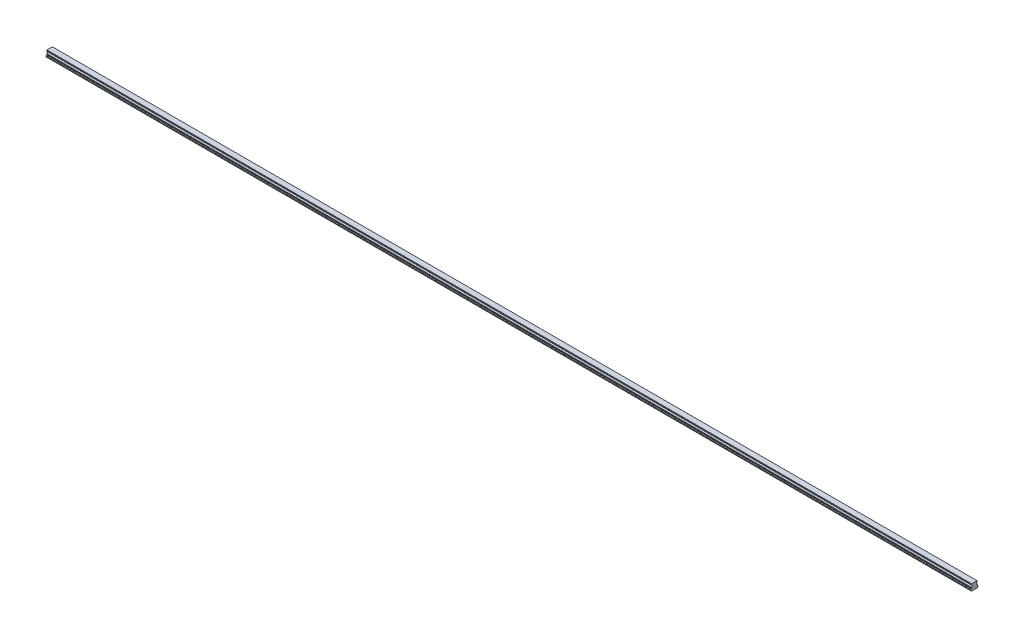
from build123d import *

# Parameters (mm, degrees)
BOSS_EXTRUDE1_DEPTH        = 3180
SKETCH3_R                  = 3
SKETCH3_R_2                = 2.5
CUT_EXTRUDE3_DEPTH         = 12
SKETCH3_2_R                = 2.5
CUT_EXTRUDE4_DEPTH         = 15
CHAMFER1_SIZE              = 0.5
LPATTERN4_COUNT            = 53
LPATTERN4_PITCH            = 60
CHAMFER1_OF_LPATTERN4_SIZE = 0.5


with BuildPart() as part:
    # Sketch1 → Boss-Extrude1 (new body)
    with BuildSketch(Plane(origin=(0, 0, 0), x_dir=(0, 0, -1), z_dir=(1, 0, 0))):
        with BuildLine():
            Line((9.375, 21.8), (-9.375, 21.8))
            Line((-9.375, 21.8), (-9.375, 20.756))
            Line((-9.375, 20.756), (-10, 19.415683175))
            Line((-10, 19.415683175), (-10, 17.685449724))
            ThreePointArc((-10, 17.685449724), (-7.2, 14.6), (-10, 11.514550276))
            Line((-10, 11.514550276), (-10, 9.784316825))
            Line((-10, 9.784316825), (-9.375, 8.444))
            Line((-9.375, 8.444), (-9.922688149, 6.4))
            Line((-9.922688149, 6.4), (-12.5, 5.489338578))
            Line((-12.5, 5.489338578), (-12.5, 2.65))
            Line((-12.5, 2.65), (-9.85, 0))
            Line((-9.85, 0), (-5.5, 0))
            Line((-5.5, 0), (-5, 0.5))
            Line((-5, 0.5), (5, 0.5))
            Line((5, 0.5), (5.5, 0))
            Line((5.5, 0), (9.85, 0))
            Line((9.85, 0), (12.5, 2.65))
            Line((12.5, 2.65), (12.5, 5.489338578))
            Line((12.5, 5.489338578), (9.922688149, 6.4))
            Line((9.922688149, 6.4), (9.375, 8.444))
            Line((9.375, 8.444), (10, 9.784316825))
            Line((10, 9.784316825), (10, 11.514550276))
            ThreePointArc((10, 11.514550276), (7.2, 14.6), (10, 17.685449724))
            Line((10, 17.685449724), (10, 19.415683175))
            Line((10, 19.415683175), (9.375, 20.756))
            Line((9.375, 20.756), (9.375, 21.8))
        make_face()
    extrude(amount=BOSS_EXTRUDE1_DEPTH)

    # Sketch3 → Cut-Extrude3 (cut)
    with BuildSketch(Plane.XZ):
        with Locations(Location((30, 0, 0), (0, 0, 270))):
            Circle(SKETCH3_R)
        with Locations(Location((30, 0, 0), (0, 0, 270))):
            Circle(SKETCH3_R_2, mode=Mode.SUBTRACT)
    cut_extrude3 = extrude(amount=-CUT_EXTRUDE3_DEPTH, mode=Mode.SUBTRACT)

    # Sketch3_2 → Cut-Extrude4 (cut)
    with BuildSketch(Plane.XZ):
        with Locations(Location((30, 0, 0), (0, 0, 270))):
            Circle(SKETCH3_2_R)
    cut_extrude4 = extrude(amount=-CUT_EXTRUDE4_DEPTH, mode=Mode.SUBTRACT)

    # Cut-Extrude5 cone 1 section (on through the dimple's axis) → Cut-Extrude5 (revolve, cut)
    with BuildSketch(Plane(origin=(30, 15, 0), x_dir=(0, 0, -1), z_dir=(1, 0, 0))):
        Polygon((0, 0), (2.5, 0), (0, 1.443375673), align=None)
    cut_extrude5 = revolve(axis=Axis((30, 15, 0), (0, 1, 0)), mode=Mode.SUBTRACT)

    # Chamfer1
    chamfer1_edges = [part.edges().sort_by_distance(p)[0] for p in [
        (30, 0.5, 3),
    ]]
    chamfer(chamfer1_edges, length=CHAMFER1_SIZE)

    # LPattern4: Cut-Extrude3, Cut-Extrude4, Cut-Extrude5 ×53
    with Locations(*[(i * LPATTERN4_PITCH, 0, 0) for i in range(1, LPATTERN4_COUNT)]):
        add(cut_extrude3, mode=Mode.SUBTRACT)
        add(cut_extrude4, mode=Mode.SUBTRACT)
        add(cut_extrude5, mode=Mode.SUBTRACT)

    # Chamfer1 of LPattern4
    chamfer1_of_lpattern4_edges = [part.edges().sort_by_distance(p)[0] for p in [
        (90, 0.5, 3),
        (150, 0.5, 3),
        (210, 0.5, 3),
        (270, 0.5, 3),
        (330, 0.5, 3),
        (390, 0.5, 3),
        (450, 0.5, 3),
        (510, 0.5, 3),
        (570, 0.5, 3),
        (630, 0.5, 3),
        (690, 0.5, 3),
        (750, 0.5, 3),
        (810, 0.5, 3),
        (870, 0.5, 3),
        (930, 0.5, 3),
        (990, 0.5, 3),
        (1050, 0.5, 3),
        (1110, 0.5, 3),
        (1170, 0.5, 3),
        (1230, 0.5, 3),
        (1290, 0.5, 3),
        (1350, 0.5, 3),
        (1410, 0.5, 3),
        (1470, 0.5, 3),
        (1530, 0.5, 3),
        (1590, 0.5, 3),
        (1650, 0.5, 3),
        (1710, 0.5, 3),
        (1770, 0.5, 3),
        (1830, 0.5, 3),
        (1890, 0.5, 3),
        (1950, 0.5, 3),
        (2010, 0.5, 3),
        (2070, 0.5, 3),
        (2130, 0.5, 3),
        (2190, 0.5, 3),
        (2250, 0.5, 3),
        (2310, 0.5, 3),
        (2370, 0.5, 3),
        (2430, 0.5, 3),
        (2490, 0.5, 3),
        (2550, 0.5, 3),
        (2610, 0.5, 3),
        (2670, 0.5, 3),
        (2730, 0.5, 3),
        (2790, 0.5, 3),
        (2850, 0.5, 3),
        (2910, 0.5, 3),
        (2970, 0.5, 3),
        (3030, 0.5, 3),
        (3090, 0.5, 3),
        (3150, 0.5, 3),
    ]]
    chamfer(chamfer1_of_lpattern4_edges, length=CHAMFER1_OF_LPATTERN4_SIZE)


solid = part.part
